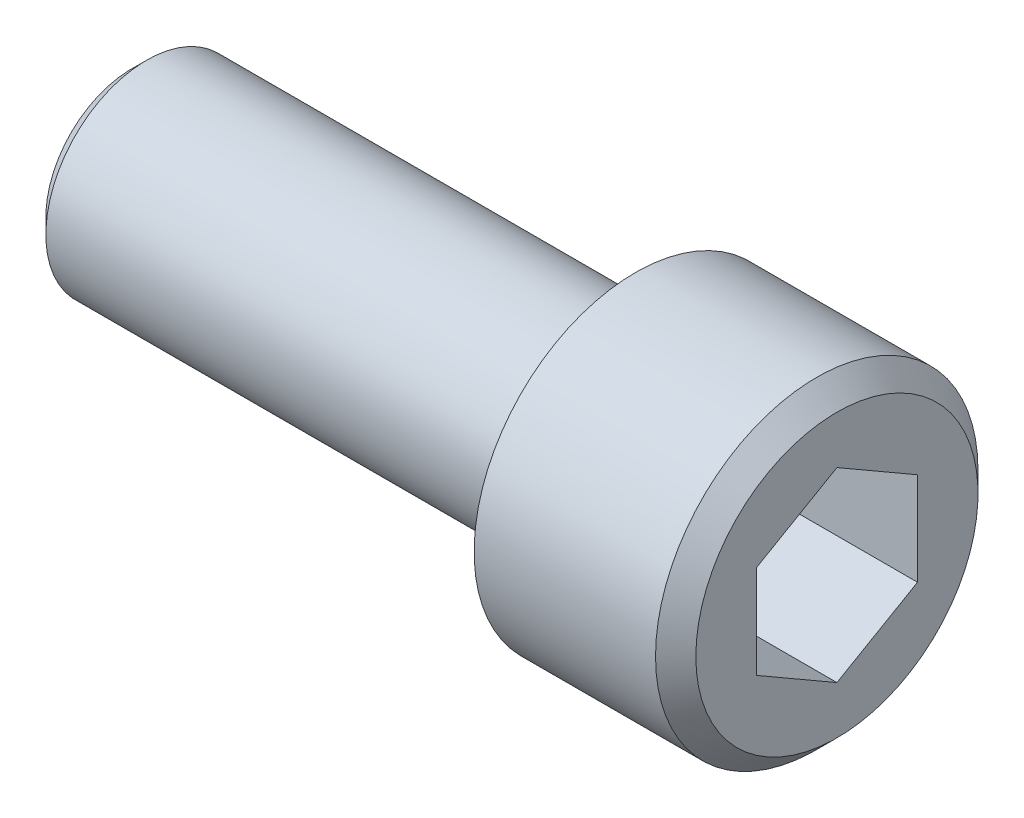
ISO-10303-21;
HEADER;
FILE_DESCRIPTION(('STEP AP214'),'2;1');
FILE_NAME('part.step','',(''),(''),'','','');
FILE_SCHEMA(('AUTOMOTIVE_DESIGN { 1 0 10303 214 1 1 1 1 }'));
ENDSEC;
DATA;
#1=APPLICATION_CONTEXT('core data for automotive mechanical design processes');
#2=APPLICATION_PROTOCOL_DEFINITION('international standard','automotive_design',2000,#1);
#3=PRODUCT_CONTEXT('',#1,'mechanical');
#4=PRODUCT('Part','Part','',(#3));
#5=PRODUCT_RELATED_PRODUCT_CATEGORY('part','',(#4));
#6=PRODUCT_DEFINITION_FORMATION('','',#4);
#7=PRODUCT_DEFINITION_CONTEXT('part definition',#1,'design');
#8=PRODUCT_DEFINITION('design','',#6,#7);
#9=PRODUCT_DEFINITION_SHAPE('','',#8);
#10=(LENGTH_UNIT() NAMED_UNIT(*) SI_UNIT(.MILLI.,.METRE.));
#11=(NAMED_UNIT(*) PLANE_ANGLE_UNIT() SI_UNIT($,.RADIAN.));
#12=(NAMED_UNIT(*) SI_UNIT($,.STERADIAN.) SOLID_ANGLE_UNIT());
#13=UNCERTAINTY_MEASURE_WITH_UNIT(LENGTH_MEASURE(1.E-05),#10,'distance_accuracy_value','');
#14=(GEOMETRIC_REPRESENTATION_CONTEXT(3) GLOBAL_UNCERTAINTY_ASSIGNED_CONTEXT((#13)) GLOBAL_UNIT_ASSIGNED_CONTEXT((#10,
#11,#12)) REPRESENTATION_CONTEXT('',''));
#15=CARTESIAN_POINT('',(0.,0.,0.));
#16=DIRECTION('',(0.,0.,1.));
#17=DIRECTION('',(1.,0.,0.));
#18=AXIS2_PLACEMENT_3D('',#15,#16,#17);
#19=CARTESIAN_POINT('',(29.,0.,0.));
#20=DIRECTION('',(1.,0.,0.));
#21=DIRECTION('',(0.,0.,-1.));
#22=AXIS2_PLACEMENT_3D('',#19,#20,#21);
#23=PLANE('',#22);
#24=DIRECTION('',(0.,-0.5,0.866025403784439));
#25=VECTOR('',#24,1.);
#26=CARTESIAN_POINT('',(29.,4.61880215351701,0.));
#27=LINE('',#26,#25);
#28=CARTESIAN_POINT('',(29.,4.61880215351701,0.));
#29=VERTEX_POINT('',#28);
#30=CARTESIAN_POINT('',(29.,2.3094010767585,4.));
#31=VERTEX_POINT('',#30);
#32=EDGE_CURVE('E83',#29,#31,#27,.T.);
#33=ORIENTED_EDGE('',*,*,#32,.T.);
#34=DIRECTION('',(0.,1.,0.));
#35=VECTOR('',#34,1.);
#36=CARTESIAN_POINT('',(29.,2.3094010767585,4.));
#37=LINE('',#36,#35);
#38=CARTESIAN_POINT('',(29.,-2.3094010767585,4.));
#39=VERTEX_POINT('',#38);
#40=EDGE_CURVE('E67',#31,#39,#37,.F.);
#41=ORIENTED_EDGE('',*,*,#40,.T.);
#42=DIRECTION('',(0.,-0.5,-0.866025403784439));
#43=VECTOR('',#42,1.);
#44=CARTESIAN_POINT('',(29.,-2.3094010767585,4.));
#45=LINE('',#44,#43);
#46=CARTESIAN_POINT('',(29.,-4.61880215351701,0.));
#47=VERTEX_POINT('',#46);
#48=EDGE_CURVE('E72',#39,#47,#45,.T.);
#49=ORIENTED_EDGE('',*,*,#48,.T.);
#50=DIRECTION('',(0.,0.5,-0.866025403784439));
#51=VECTOR('',#50,1.);
#52=CARTESIAN_POINT('',(29.,-4.61880215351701,0.));
#53=LINE('',#52,#51);
#54=CARTESIAN_POINT('',(29.,-2.3094010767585,-4.));
#55=VERTEX_POINT('',#54);
#56=EDGE_CURVE('E128',#47,#55,#53,.T.);
#57=ORIENTED_EDGE('',*,*,#56,.T.);
#58=DIRECTION('',(0.,1.,0.));
#59=VECTOR('',#58,1.);
#60=CARTESIAN_POINT('',(29.,-2.3094010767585,-4.));
#61=LINE('',#60,#59);
#62=CARTESIAN_POINT('',(29.,2.3094010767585,-4.));
#63=VERTEX_POINT('',#62);
#64=EDGE_CURVE('E132',#55,#63,#61,.T.);
#65=ORIENTED_EDGE('',*,*,#64,.T.);
#66=DIRECTION('',(0.,0.5,0.866025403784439));
#67=VECTOR('',#66,1.);
#68=CARTESIAN_POINT('',(29.,2.3094010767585,-4.));
#69=LINE('',#68,#67);
#70=EDGE_CURVE('E137',#63,#29,#69,.T.);
#71=ORIENTED_EDGE('',*,*,#70,.T.);
#72=EDGE_LOOP('',(#33,#41,#49,#57,#65,#71));
#73=FACE_BOUND('',#72,.T.);
#74=ADVANCED_FACE('F17',(#73),#23,.T.);
#75=CARTESIAN_POINT('',(35.,-2.3094010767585,4.));
#76=DIRECTION('',(0.,-0.866025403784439,0.5));
#77=DIRECTION('',(0.,-0.5,-0.866025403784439));
#78=AXIS2_PLACEMENT_3D('',#75,#76,#77);
#79=PLANE('',#78);
#80=DIRECTION('',(1.,0.,0.));
#81=VECTOR('',#80,1.);
#82=CARTESIAN_POINT('',(35.,-2.3094010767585,4.));
#83=LINE('',#82,#81);
#84=CARTESIAN_POINT('',(35.,-2.3094010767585,4.));
#85=VERTEX_POINT('',#84);
#86=EDGE_CURVE('E74',#39,#85,#83,.T.);
#87=ORIENTED_EDGE('',*,*,#86,.T.);
#88=DIRECTION('',(0.,0.5,0.866025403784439));
#89=VECTOR('',#88,1.);
#90=CARTESIAN_POINT('',(35.,-4.61880215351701,0.));
#91=LINE('',#90,#89);
#92=CARTESIAN_POINT('',(35.,-4.61880215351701,0.));
#93=VERTEX_POINT('',#92);
#94=EDGE_CURVE('E126',#93,#85,#91,.T.);
#95=ORIENTED_EDGE('',*,*,#94,.F.);
#96=DIRECTION('',(1.,0.,0.));
#97=VECTOR('',#96,1.);
#98=CARTESIAN_POINT('',(35.,-4.61880215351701,0.));
#99=LINE('',#98,#97);
#100=EDGE_CURVE('E77',#93,#47,#99,.F.);
#101=ORIENTED_EDGE('',*,*,#100,.T.);
#102=ORIENTED_EDGE('',*,*,#48,.F.);
#103=EDGE_LOOP('',(#87,#95,#101,#102));
#104=FACE_BOUND('',#103,.T.);
#105=ADVANCED_FACE('F73',(#104),#79,.F.);
#106=CARTESIAN_POINT('',(35.,2.3094010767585,4.));
#107=DIRECTION('',(0.,0.,1.));
#108=DIRECTION('',(1.,0.,0.));
#109=AXIS2_PLACEMENT_3D('',#106,#107,#108);
#110=PLANE('',#109);
#111=DIRECTION('',(1.,0.,0.));
#112=VECTOR('',#111,1.);
#113=CARTESIAN_POINT('',(35.,2.3094010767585,4.));
#114=LINE('',#113,#112);
#115=CARTESIAN_POINT('',(35.,2.3094010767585,4.));
#116=VERTEX_POINT('',#115);
#117=EDGE_CURVE('E85',#31,#116,#114,.T.);
#118=ORIENTED_EDGE('',*,*,#117,.T.);
#119=DIRECTION('',(0.,1.,0.));
#120=VECTOR('',#119,1.);
#121=CARTESIAN_POINT('',(35.,3.5,4.));
#122=LINE('',#121,#120);
#123=EDGE_CURVE('E89',#85,#116,#122,.T.);
#124=ORIENTED_EDGE('',*,*,#123,.F.);
#125=ORIENTED_EDGE('',*,*,#86,.F.);
#126=ORIENTED_EDGE('',*,*,#40,.F.);
#127=EDGE_LOOP('',(#118,#124,#125,#126));
#128=FACE_BOUND('',#127,.T.);
#129=ADVANCED_FACE('F87',(#128),#110,.F.);
#130=CARTESIAN_POINT('',(35.,4.61880215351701,0.));
#131=DIRECTION('',(0.,0.866025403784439,0.5));
#132=DIRECTION('',(0.,-0.5,0.866025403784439));
#133=AXIS2_PLACEMENT_3D('',#130,#131,#132);
#134=PLANE('',#133);
#135=DIRECTION('',(1.,0.,0.));
#136=VECTOR('',#135,1.);
#137=CARTESIAN_POINT('',(35.,4.61880215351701,0.));
#138=LINE('',#137,#136);
#139=CARTESIAN_POINT('',(35.,4.61880215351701,0.));
#140=VERTEX_POINT('',#139);
#141=EDGE_CURVE('E139',#29,#140,#138,.T.);
#142=ORIENTED_EDGE('',*,*,#141,.T.);
#143=DIRECTION('',(0.,0.5,-0.866025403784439));
#144=VECTOR('',#143,1.);
#145=CARTESIAN_POINT('',(35.,2.3094010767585,4.));
#146=LINE('',#145,#144);
#147=EDGE_CURVE('E122',#116,#140,#146,.T.);
#148=ORIENTED_EDGE('',*,*,#147,.F.);
#149=ORIENTED_EDGE('',*,*,#117,.F.);
#150=ORIENTED_EDGE('',*,*,#32,.F.);
#151=EDGE_LOOP('',(#142,#148,#149,#150));
#152=FACE_BOUND('',#151,.T.);
#153=ADVANCED_FACE('F143',(#152),#134,.F.);
#154=CARTESIAN_POINT('',(35.,2.3094010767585,-4.));
#155=DIRECTION('',(0.,0.866025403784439,-0.5));
#156=DIRECTION('',(0.,0.5,0.866025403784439));
#157=AXIS2_PLACEMENT_3D('',#154,#155,#156);
#158=PLANE('',#157);
#159=DIRECTION('',(-1.,0.,0.));
#160=VECTOR('',#159,1.);
#161=CARTESIAN_POINT('',(35.,2.3094010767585,-4.));
#162=LINE('',#161,#160);
#163=CARTESIAN_POINT('',(35.,2.3094010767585,-4.));
#164=VERTEX_POINT('',#163);
#165=EDGE_CURVE('E135',#63,#164,#162,.F.);
#166=ORIENTED_EDGE('',*,*,#165,.T.);
#167=DIRECTION('',(0.,-0.5,-0.866025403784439));
#168=VECTOR('',#167,1.);
#169=CARTESIAN_POINT('',(35.,4.61880215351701,0.));
#170=LINE('',#169,#168);
#171=EDGE_CURVE('E119',#140,#164,#170,.T.);
#172=ORIENTED_EDGE('',*,*,#171,.F.);
#173=ORIENTED_EDGE('',*,*,#141,.F.);
#174=ORIENTED_EDGE('',*,*,#70,.F.);
#175=EDGE_LOOP('',(#166,#172,#173,#174));
#176=FACE_BOUND('',#175,.T.);
#177=ADVANCED_FACE('F154',(#176),#158,.F.);
#178=CARTESIAN_POINT('',(35.,-2.3094010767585,-4.));
#179=DIRECTION('',(0.,0.,-1.));
#180=DIRECTION('',(-1.,0.,0.));
#181=AXIS2_PLACEMENT_3D('',#178,#179,#180);
#182=PLANE('',#181);
#183=DIRECTION('',(1.,0.,0.));
#184=VECTOR('',#183,1.);
#185=CARTESIAN_POINT('',(35.,-2.3094010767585,-4.));
#186=LINE('',#185,#184);
#187=CARTESIAN_POINT('',(35.,-2.3094010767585,-4.));
#188=VERTEX_POINT('',#187);
#189=EDGE_CURVE('E35',#55,#188,#186,.T.);
#190=ORIENTED_EDGE('',*,*,#189,.T.);
#191=DIRECTION('',(0.,1.,0.));
#192=VECTOR('',#191,1.);
#193=CARTESIAN_POINT('',(35.,3.5,-4.));
#194=LINE('',#193,#192);
#195=EDGE_CURVE('E116',#164,#188,#194,.F.);
#196=ORIENTED_EDGE('',*,*,#195,.F.);
#197=ORIENTED_EDGE('',*,*,#165,.F.);
#198=ORIENTED_EDGE('',*,*,#64,.F.);
#199=EDGE_LOOP('',(#190,#196,#197,#198));
#200=FACE_BOUND('',#199,.T.);
#201=ADVANCED_FACE('F152',(#200),#182,.F.);
#202=CARTESIAN_POINT('',(35.,-4.61880215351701,0.));
#203=DIRECTION('',(0.,-0.866025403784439,-0.5));
#204=DIRECTION('',(0.,0.5,-0.866025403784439));
#205=AXIS2_PLACEMENT_3D('',#202,#203,#204);
#206=PLANE('',#205);
#207=ORIENTED_EDGE('',*,*,#100,.F.);
#208=DIRECTION('',(0.,-0.5,0.866025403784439));
#209=VECTOR('',#208,1.);
#210=CARTESIAN_POINT('',(35.,-2.3094010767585,-4.));
#211=LINE('',#210,#209);
#212=EDGE_CURVE('E108',#188,#93,#211,.T.);
#213=ORIENTED_EDGE('',*,*,#212,.F.);
#214=ORIENTED_EDGE('',*,*,#189,.F.);
#215=ORIENTED_EDGE('',*,*,#56,.F.);
#216=EDGE_LOOP('',(#207,#213,#214,#215));
#217=FACE_BOUND('',#216,.T.);
#218=ADVANCED_FACE('F150',(#217),#206,.F.);
#219=CARTESIAN_POINT('',(35.,3.5,0.));
#220=DIRECTION('',(1.,0.,0.));
#221=DIRECTION('',(0.,0.,-1.));
#222=AXIS2_PLACEMENT_3D('',#219,#220,#221);
#223=PLANE('',#222);
#224=ORIENTED_EDGE('',*,*,#195,.T.);
#225=ORIENTED_EDGE('',*,*,#212,.T.);
#226=ORIENTED_EDGE('',*,*,#94,.T.);
#227=ORIENTED_EDGE('',*,*,#123,.T.);
#228=ORIENTED_EDGE('',*,*,#147,.T.);
#229=ORIENTED_EDGE('',*,*,#171,.T.);
#230=EDGE_LOOP('',(#224,#225,#226,#227,#228,#229));
#231=FACE_BOUND('',#230,.T.);
#232=CARTESIAN_POINT('',(35.0000000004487,0.,0.));
#233=DIRECTION('',(-1.,0.,0.));
#234=DIRECTION('',(0.,0.,1.));
#235=AXIS2_PLACEMENT_3D('',#232,#233,#234);
#236=CIRCLE('',#235,7.00000000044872);
#237=CARTESIAN_POINT('',(35.0000000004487,0.,7.00000000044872));
#238=VERTEX_POINT('',#237);
#239=EDGE_CURVE('E20',#238,#238,#236,.T.);
#240=ORIENTED_EDGE('',*,*,#239,.F.);
#241=EDGE_LOOP('',(#240));
#242=FACE_BOUND('',#241,.T.);
#243=ADVANCED_FACE('F147',(#231,#242),#223,.T.);
#244=CARTESIAN_POINT('',(33.9999999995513,0.,0.));
#245=DIRECTION('',(-1.,0.,0.));
#246=DIRECTION('',(0.,0.,1.));
#247=AXIS2_PLACEMENT_3D('',#244,#245,#246);
#248=CONICAL_SURFACE('',#247,7.99999999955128,0.785398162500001);
#249=CARTESIAN_POINT('',(34.,0.,0.));
#250=DIRECTION('',(1.,0.,0.));
#251=DIRECTION('',(0.,0.,-1.));
#252=AXIS2_PLACEMENT_3D('',#249,#250,#251);
#253=CIRCLE('',#252,8.);
#254=CARTESIAN_POINT('',(34.,0.,-8.));
#255=VERTEX_POINT('',#254);
#256=EDGE_CURVE('E100',#255,#255,#253,.F.);
#257=ORIENTED_EDGE('',*,*,#256,.F.);
#258=EDGE_LOOP('',(#257));
#259=FACE_BOUND('',#258,.T.);
#260=ORIENTED_EDGE('',*,*,#239,.T.);
#261=EDGE_LOOP('',(#260));
#262=FACE_BOUND('',#261,.T.);
#263=ADVANCED_FACE('F187',(#259,#262),#248,.T.);
#264=CARTESIAN_POINT('',(29.5,0.,0.));
#265=DIRECTION('',(1.,0.,0.));
#266=DIRECTION('',(0.,0.,-1.));
#267=AXIS2_PLACEMENT_3D('',#264,#265,#266);
#268=CYLINDRICAL_SURFACE('',#267,8.);
#269=CARTESIAN_POINT('',(25.,0.,0.));
#270=DIRECTION('',(1.,0.,0.));
#271=DIRECTION('',(0.,0.,-1.));
#272=AXIS2_PLACEMENT_3D('',#269,#270,#271);
#273=CIRCLE('',#272,8.);
#274=CARTESIAN_POINT('',(25.,0.,-8.));
#275=VERTEX_POINT('',#274);
#276=EDGE_CURVE('E98',#275,#275,#273,.F.);
#277=ORIENTED_EDGE('',*,*,#276,.F.);
#278=EDGE_LOOP('',(#277));
#279=FACE_BOUND('',#278,.T.);
#280=ORIENTED_EDGE('',*,*,#256,.T.);
#281=EDGE_LOOP('',(#280));
#282=FACE_BOUND('',#281,.T.);
#283=ADVANCED_FACE('F183',(#279,#282),#268,.T.);
#284=CARTESIAN_POINT('',(0.,2.125,0.));
#285=DIRECTION('',(-1.,0.,0.));
#286=DIRECTION('',(0.,0.,1.));
#287=AXIS2_PLACEMENT_3D('',#284,#285,#286);
#288=PLANE('',#287);
#289=CARTESIAN_POINT('',(-2.8421709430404E-10,0.,0.));
#290=DIRECTION('',(1.,0.,0.));
#291=DIRECTION('',(0.,0.,-1.));
#292=AXIS2_PLACEMENT_3D('',#289,#290,#291);
#293=CIRCLE('',#292,4.25000000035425);
#294=CARTESIAN_POINT('',(-2.8421709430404E-10,0.,-4.25000000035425));
#295=VERTEX_POINT('',#294);
#296=EDGE_CURVE('E96',#295,#295,#293,.T.);
#297=ORIENTED_EDGE('',*,*,#296,.F.);
#298=EDGE_LOOP('',(#297));
#299=FACE_BOUND('',#298,.T.);
#300=ADVANCED_FACE('F179',(#299),#288,.T.);
#301=CARTESIAN_POINT('',(25.,6.5,0.));
#302=DIRECTION('',(-1.,0.,0.));
#303=DIRECTION('',(0.,0.,1.));
#304=AXIS2_PLACEMENT_3D('',#301,#302,#303);
#305=PLANE('',#304);
#306=CARTESIAN_POINT('',(25.,0.,0.));
#307=DIRECTION('',(1.,0.,0.));
#308=DIRECTION('',(0.,0.,-1.));
#309=AXIS2_PLACEMENT_3D('',#306,#307,#308);
#310=CIRCLE('',#309,5.);
#311=CARTESIAN_POINT('',(25.,0.,-5.));
#312=VERTEX_POINT('',#311);
#313=EDGE_CURVE('E26',#312,#312,#310,.F.);
#314=ORIENTED_EDGE('',*,*,#313,.F.);
#315=EDGE_LOOP('',(#314));
#316=FACE_BOUND('',#315,.T.);
#317=ORIENTED_EDGE('',*,*,#276,.T.);
#318=EDGE_LOOP('',(#317));
#319=FACE_BOUND('',#318,.T.);
#320=ADVANCED_FACE('F172',(#316,#319),#305,.T.);
#321=CARTESIAN_POINT('',(0.750000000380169,0.,0.));
#322=DIRECTION('',(1.,0.,0.));
#323=DIRECTION('',(0.,0.,-1.));
#324=AXIS2_PLACEMENT_3D('',#321,#322,#323);
#325=CONICAL_SURFACE('',#324,4.99999999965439,0.785398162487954);
#326=ORIENTED_EDGE('',*,*,#296,.T.);
#327=EDGE_LOOP('',(#326));
#328=FACE_BOUND('',#327,.T.);
#329=CARTESIAN_POINT('',(0.749999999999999,0.,0.));
#330=DIRECTION('',(1.,0.,0.));
#331=DIRECTION('',(0.,0.,-1.));
#332=AXIS2_PLACEMENT_3D('',#329,#330,#331);
#333=CIRCLE('',#332,5.);
#334=CARTESIAN_POINT('',(0.749999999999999,0.,-5.));
#335=VERTEX_POINT('',#334);
#336=EDGE_CURVE('E11',#335,#335,#333,.T.);
#337=ORIENTED_EDGE('',*,*,#336,.F.);
#338=EDGE_LOOP('',(#337));
#339=FACE_BOUND('',#338,.T.);
#340=ADVANCED_FACE('F166',(#328,#339),#325,.T.);
#341=CARTESIAN_POINT('',(12.875,0.,0.));
#342=DIRECTION('',(1.,0.,0.));
#343=DIRECTION('',(0.,0.,-1.));
#344=AXIS2_PLACEMENT_3D('',#341,#342,#343);
#345=CYLINDRICAL_SURFACE('',#344,5.);
#346=ORIENTED_EDGE('',*,*,#336,.T.);
#347=EDGE_LOOP('',(#346));
#348=FACE_BOUND('',#347,.T.);
#349=ORIENTED_EDGE('',*,*,#313,.T.);
#350=EDGE_LOOP('',(#349));
#351=FACE_BOUND('',#350,.T.);
#352=ADVANCED_FACE('F164',(#348,#351),#345,.T.);
#353=CLOSED_SHELL('',(#74,#105,#129,#153,#177,#201,#218,#243,#263,#283,#300,#320,#340,#352));
#354=MANIFOLD_SOLID_BREP('B1',#353);
#355=ADVANCED_BREP_SHAPE_REPRESENTATION('',(#18,#354),#14);
#356=SHAPE_DEFINITION_REPRESENTATION(#9,#355);
ENDSEC;
END-ISO-10303-21;
